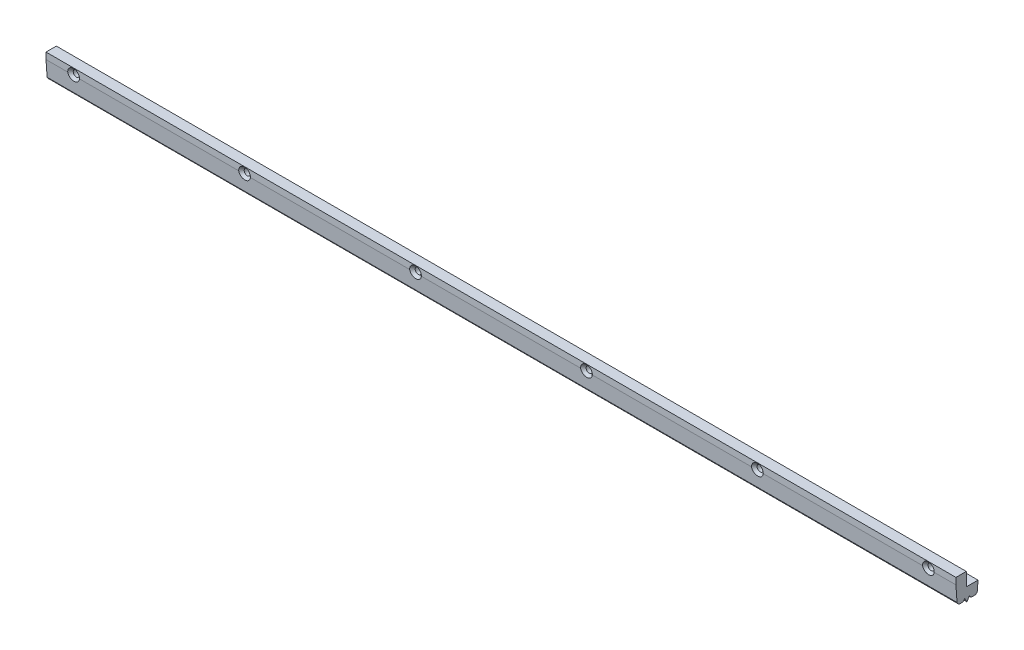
from build123d import *

# Parameters (mm, degrees)
EXTRUSION1_DEPTH                               = 330
FRAISAGE_POUR_VIS_T_TE_FRAIS_E_M41_D           = 4.5
FRAISAGE_POUR_VIS_T_TE_FRAIS_E_M41_CSINK_D     = 8.5
FRAISAGE_POUR_VIS_T_TE_FRAIS_E_M41_CSINK_ANGLE = 90


with BuildPart() as part:
    # Esquisse1 → Extrusion1 (new, symmetric)
    with BuildSketch(Plane(origin=(0, 0, 0), x_dir=(0, 0, -1), z_dir=(1, 0, 0))):
        with BuildLine():
            Line((8, 9.7), (7.549705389, 3.260487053))
            ThreePointArc((7.549705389, 3.260487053), (6.918574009, 1.937292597), (5.554577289, 1.4))
            Line((5.554577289, 1.4), (3.269059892, 1.4))
            ThreePointArc((3.269059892, 1.4), (2.769059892, 1.533974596), (2.403034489, 1.9))
            Line((2.403034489, 1.9), (1.75, 3.031088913))
            Line((1.75, 3.031088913), (0, 0))
            Line((0, 0), (-1.75, 3.031088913))
            Line((-1.75, 3.031088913), (-2.403034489, 1.9))
            ThreePointArc((-2.403034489, 1.9), (-2.769059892, 1.533974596), (-3.269059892, 1.4))
            Line((-3.269059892, 1.4), (-4.704943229, 1.4))
            ThreePointArc((-4.704943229, 1.4), (-6.273681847, 1.899511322), (-7.200071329, 3.260487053))
            Line((-7.200071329, 3.260487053), (-8, 14.7))
            Line((-8, 14.7), (-8, 19.4))
            Line((-8, 19.4), (-0.5, 19.4))
            Line((-0.5, 19.4), (-0.5, 9.7))
            Line((-0.5, 9.7), (8, 9.7))
        make_face()
    extrude(amount=EXTRUSION1_DEPTH, both=True)

    # Fraisage pour vis _ t_te frais_e M41 (through all)
    with Locations(Plane.XY.offset(8)):
        with Locations((-310, 14.9), (-186, 14.9), (-62, 14.9), (62, 14.9), (186, 14.9), (310, 14.9)):
            CounterSinkHole(FRAISAGE_POUR_VIS_T_TE_FRAIS_E_M41_D / 2, FRAISAGE_POUR_VIS_T_TE_FRAIS_E_M41_CSINK_D / 2, counter_sink_angle=FRAISAGE_POUR_VIS_T_TE_FRAIS_E_M41_CSINK_ANGLE)


solid = part.part
